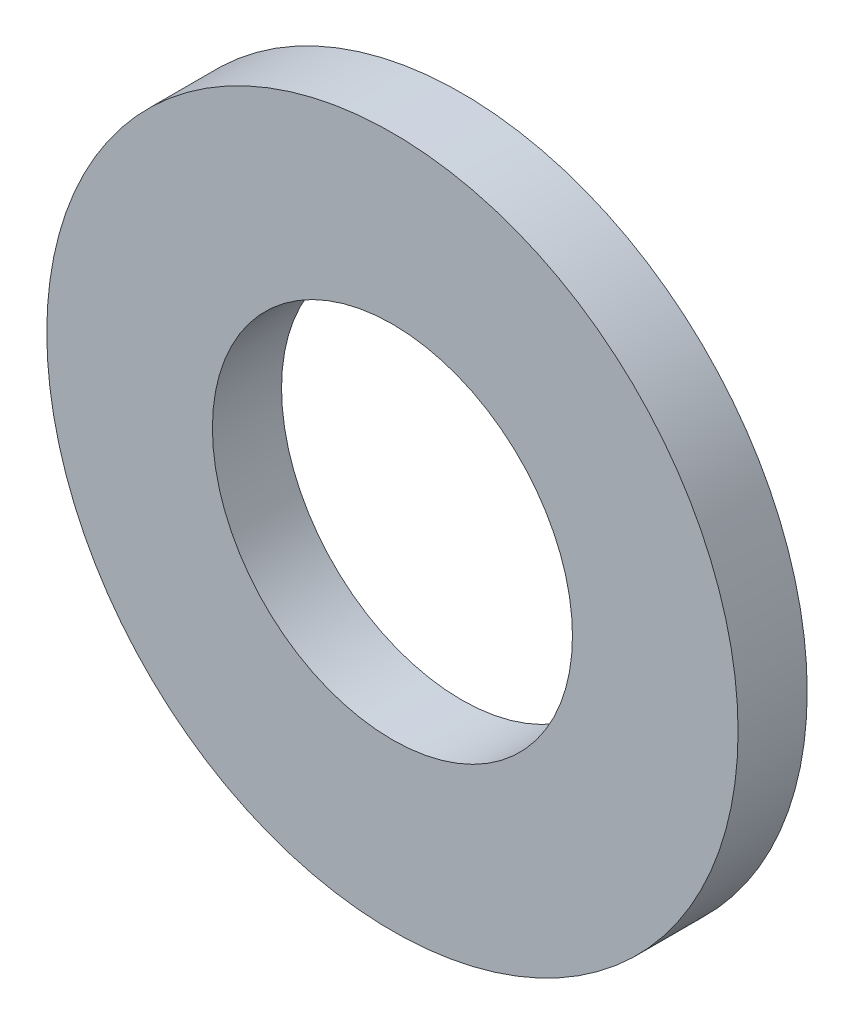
ISO-10303-21;
HEADER;
FILE_DESCRIPTION(('STEP AP214'),'2;1');
FILE_NAME('part.step','',(''),(''),'','','');
FILE_SCHEMA(('AUTOMOTIVE_DESIGN { 1 0 10303 214 1 1 1 1 }'));
ENDSEC;
DATA;
#1=APPLICATION_CONTEXT('core data for automotive mechanical design processes');
#2=APPLICATION_PROTOCOL_DEFINITION('international standard','automotive_design',2000,#1);
#3=PRODUCT_CONTEXT('',#1,'mechanical');
#4=PRODUCT('Part','Part','',(#3));
#5=PRODUCT_RELATED_PRODUCT_CATEGORY('part','',(#4));
#6=PRODUCT_DEFINITION_FORMATION('','',#4);
#7=PRODUCT_DEFINITION_CONTEXT('part definition',#1,'design');
#8=PRODUCT_DEFINITION('design','',#6,#7);
#9=PRODUCT_DEFINITION_SHAPE('','',#8);
#10=(LENGTH_UNIT() NAMED_UNIT(*) SI_UNIT(.MILLI.,.METRE.));
#11=(NAMED_UNIT(*) PLANE_ANGLE_UNIT() SI_UNIT($,.RADIAN.));
#12=(NAMED_UNIT(*) SI_UNIT($,.STERADIAN.) SOLID_ANGLE_UNIT());
#13=UNCERTAINTY_MEASURE_WITH_UNIT(LENGTH_MEASURE(1.E-05),#10,'distance_accuracy_value','');
#14=(GEOMETRIC_REPRESENTATION_CONTEXT(3) GLOBAL_UNCERTAINTY_ASSIGNED_CONTEXT((#13)) GLOBAL_UNIT_ASSIGNED_CONTEXT((#10,
#11,#12)) REPRESENTATION_CONTEXT('',''));
#15=CARTESIAN_POINT('',(0.,0.,0.));
#16=DIRECTION('',(0.,0.,1.));
#17=DIRECTION('',(1.,0.,0.));
#18=AXIS2_PLACEMENT_3D('',#15,#16,#17);
#19=CARTESIAN_POINT('',(0.,0.,1.19999999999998));
#20=DIRECTION('',(0.,0.,1.));
#21=DIRECTION('',(1.,0.,0.));
#22=AXIS2_PLACEMENT_3D('',#19,#20,#21);
#23=PLANE('',#22);
#24=CARTESIAN_POINT('',(0.,0.,1.19999999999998));
#25=DIRECTION('',(0.,0.,1.));
#26=DIRECTION('',(1.,0.,0.));
#27=AXIS2_PLACEMENT_3D('',#24,#25,#26);
#28=CIRCLE('',#27,6.);
#29=CARTESIAN_POINT('',(6.,0.,1.19999999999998));
#30=VERTEX_POINT('',#29);
#31=EDGE_CURVE('E10',#30,#30,#28,.T.);
#32=ORIENTED_EDGE('',*,*,#31,.T.);
#33=EDGE_LOOP('',(#32));
#34=FACE_BOUND('',#33,.T.);
#35=CARTESIAN_POINT('',(0.,0.,1.19999999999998));
#36=DIRECTION('',(0.,0.,1.));
#37=DIRECTION('',(1.,0.,0.));
#38=AXIS2_PLACEMENT_3D('',#35,#36,#37);
#39=CIRCLE('',#38,3.125);
#40=CARTESIAN_POINT('',(3.125,0.,1.19999999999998));
#41=VERTEX_POINT('',#40);
#42=EDGE_CURVE('E25',#41,#41,#39,.T.);
#43=ORIENTED_EDGE('',*,*,#42,.F.);
#44=EDGE_LOOP('',(#43));
#45=FACE_BOUND('',#44,.T.);
#46=ADVANCED_FACE('F14',(#34,#45),#23,.T.);
#47=CARTESIAN_POINT('',(0.,0.,0.));
#48=DIRECTION('',(0.,0.,1.));
#49=DIRECTION('',(1.,0.,0.));
#50=AXIS2_PLACEMENT_3D('',#47,#48,#49);
#51=PLANE('',#50);
#52=CARTESIAN_POINT('',(0.,0.,0.));
#53=DIRECTION('',(0.,0.,1.));
#54=DIRECTION('',(1.,0.,0.));
#55=AXIS2_PLACEMENT_3D('',#52,#53,#54);
#56=CIRCLE('',#55,6.);
#57=CARTESIAN_POINT('',(6.,0.,0.));
#58=VERTEX_POINT('',#57);
#59=EDGE_CURVE('E18',#58,#58,#56,.T.);
#60=ORIENTED_EDGE('',*,*,#59,.F.);
#61=EDGE_LOOP('',(#60));
#62=FACE_BOUND('',#61,.T.);
#63=CARTESIAN_POINT('',(0.,0.,0.));
#64=DIRECTION('',(0.,0.,1.));
#65=DIRECTION('',(1.,0.,0.));
#66=AXIS2_PLACEMENT_3D('',#63,#64,#65);
#67=CIRCLE('',#66,3.125);
#68=CARTESIAN_POINT('',(3.125,0.,0.));
#69=VERTEX_POINT('',#68);
#70=EDGE_CURVE('E27',#69,#69,#67,.T.);
#71=ORIENTED_EDGE('',*,*,#70,.T.);
#72=EDGE_LOOP('',(#71));
#73=FACE_BOUND('',#72,.T.);
#74=ADVANCED_FACE('F37',(#62,#73),#51,.F.);
#75=CARTESIAN_POINT('',(0.,0.,1.19999999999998));
#76=DIRECTION('',(0.,0.,-1.));
#77=DIRECTION('',(-1.,0.,0.));
#78=AXIS2_PLACEMENT_3D('',#75,#76,#77);
#79=CYLINDRICAL_SURFACE('',#78,6.);
#80=ORIENTED_EDGE('',*,*,#31,.F.);
#81=EDGE_LOOP('',(#80));
#82=FACE_BOUND('',#81,.T.);
#83=ORIENTED_EDGE('',*,*,#59,.T.);
#84=EDGE_LOOP('',(#83));
#85=FACE_BOUND('',#84,.T.);
#86=ADVANCED_FACE('F16',(#82,#85),#79,.T.);
#87=CARTESIAN_POINT('',(0.,0.,1.19999999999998));
#88=DIRECTION('',(0.,0.,-1.));
#89=DIRECTION('',(-1.,0.,0.));
#90=AXIS2_PLACEMENT_3D('',#87,#88,#89);
#91=CYLINDRICAL_SURFACE('',#90,3.125);
#92=ORIENTED_EDGE('',*,*,#42,.T.);
#93=EDGE_LOOP('',(#92));
#94=FACE_BOUND('',#93,.T.);
#95=ORIENTED_EDGE('',*,*,#70,.F.);
#96=EDGE_LOOP('',(#95));
#97=FACE_BOUND('',#96,.T.);
#98=ADVANCED_FACE('F33',(#94,#97),#91,.F.);
#99=CLOSED_SHELL('',(#46,#74,#86,#98));
#100=MANIFOLD_SOLID_BREP('B1',#99);
#101=ADVANCED_BREP_SHAPE_REPRESENTATION('',(#18,#100),#14);
#102=SHAPE_DEFINITION_REPRESENTATION(#9,#101);
ENDSEC;
END-ISO-10303-21;
